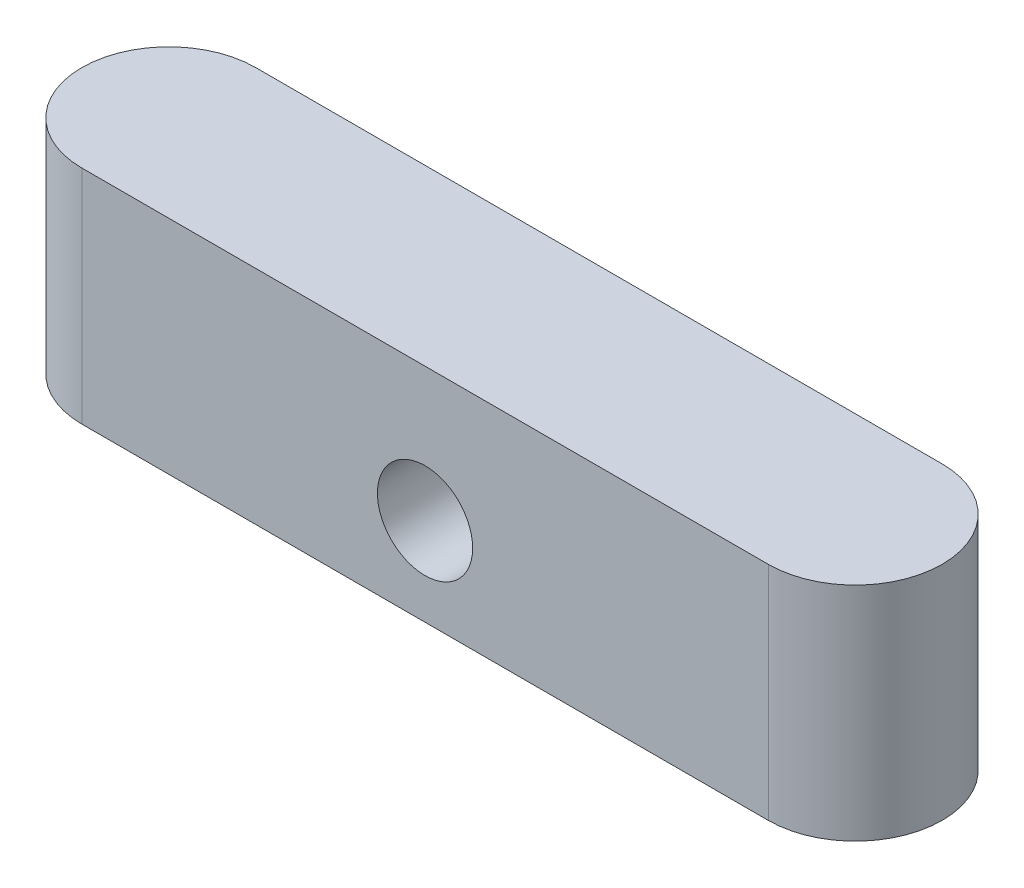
ISO-10303-21;
HEADER;
FILE_DESCRIPTION(('STEP AP214'),'2;1');
FILE_NAME('part.step','',(''),(''),'','','');
FILE_SCHEMA(('AUTOMOTIVE_DESIGN { 1 0 10303 214 1 1 1 1 }'));
ENDSEC;
DATA;
#1=APPLICATION_CONTEXT('core data for automotive mechanical design processes');
#2=APPLICATION_PROTOCOL_DEFINITION('international standard','automotive_design',2000,#1);
#3=PRODUCT_CONTEXT('',#1,'mechanical');
#4=PRODUCT('Part','Part','',(#3));
#5=PRODUCT_RELATED_PRODUCT_CATEGORY('part','',(#4));
#6=PRODUCT_DEFINITION_FORMATION('','',#4);
#7=PRODUCT_DEFINITION_CONTEXT('part definition',#1,'design');
#8=PRODUCT_DEFINITION('design','',#6,#7);
#9=PRODUCT_DEFINITION_SHAPE('','',#8);
#10=(LENGTH_UNIT() NAMED_UNIT(*) SI_UNIT(.MILLI.,.METRE.));
#11=(NAMED_UNIT(*) PLANE_ANGLE_UNIT() SI_UNIT($,.RADIAN.));
#12=(NAMED_UNIT(*) SI_UNIT($,.STERADIAN.) SOLID_ANGLE_UNIT());
#13=UNCERTAINTY_MEASURE_WITH_UNIT(LENGTH_MEASURE(1.E-05),#10,'distance_accuracy_value','');
#14=(GEOMETRIC_REPRESENTATION_CONTEXT(3) GLOBAL_UNCERTAINTY_ASSIGNED_CONTEXT((#13)) GLOBAL_UNIT_ASSIGNED_CONTEXT((#10,
#11,#12)) REPRESENTATION_CONTEXT('',''));
#15=CARTESIAN_POINT('',(0.,0.,0.));
#16=DIRECTION('',(0.,0.,1.));
#17=DIRECTION('',(1.,0.,0.));
#18=AXIS2_PLACEMENT_3D('',#15,#16,#17);
#19=CARTESIAN_POINT('',(-9.75,3.15,0.));
#20=DIRECTION('',(0.,-1.,0.));
#21=DIRECTION('',(0.,0.,-1.));
#22=AXIS2_PLACEMENT_3D('',#19,#20,#21);
#23=CYLINDRICAL_SURFACE('',#22,2.47015);
#24=CARTESIAN_POINT('',(-9.75,-3.15,0.));
#25=DIRECTION('',(0.,1.,0.));
#26=DIRECTION('',(0.,0.,1.));
#27=AXIS2_PLACEMENT_3D('',#24,#25,#26);
#28=CIRCLE('',#27,2.47015);
#29=CARTESIAN_POINT('',(-9.75,-3.15,-2.47015));
#30=VERTEX_POINT('',#29);
#31=CARTESIAN_POINT('',(-9.75,-3.15,2.47015));
#32=VERTEX_POINT('',#31);
#33=EDGE_CURVE('E97',#30,#32,#28,.T.);
#34=ORIENTED_EDGE('',*,*,#33,.T.);
#35=DIRECTION('',(0.,-1.,0.));
#36=VECTOR('',#35,1.);
#37=CARTESIAN_POINT('',(-9.75,3.15,2.47015));
#38=LINE('',#37,#36);
#39=CARTESIAN_POINT('',(-9.75,3.15,2.47015));
#40=VERTEX_POINT('',#39);
#41=EDGE_CURVE('E11',#40,#32,#38,.T.);
#42=ORIENTED_EDGE('',*,*,#41,.F.);
#43=CARTESIAN_POINT('',(-9.75,3.15,0.));
#44=DIRECTION('',(0.,1.,0.));
#45=DIRECTION('',(0.,0.,1.));
#46=AXIS2_PLACEMENT_3D('',#43,#44,#45);
#47=CIRCLE('',#46,2.47015);
#48=CARTESIAN_POINT('',(-9.75,3.15,-2.47015));
#49=VERTEX_POINT('',#48);
#50=EDGE_CURVE('E85',#49,#40,#47,.T.);
#51=ORIENTED_EDGE('',*,*,#50,.F.);
#52=DIRECTION('',(0.,-1.,0.));
#53=VECTOR('',#52,1.);
#54=CARTESIAN_POINT('',(-9.75,3.15,-2.47015));
#55=LINE('',#54,#53);
#56=EDGE_CURVE('E93',#49,#30,#55,.T.);
#57=ORIENTED_EDGE('',*,*,#56,.T.);
#58=EDGE_LOOP('',(#34,#42,#51,#57));
#59=FACE_BOUND('',#58,.T.);
#60=ADVANCED_FACE('F34',(#59),#23,.T.);
#61=CARTESIAN_POINT('',(-9.75,3.15,2.47015));
#62=DIRECTION('',(0.,0.,-1.));
#63=DIRECTION('',(-1.,0.,0.));
#64=AXIS2_PLACEMENT_3D('',#61,#62,#63);
#65=PLANE('',#64);
#66=CARTESIAN_POINT('',(0.,-0.65,2.47015));
#67=DIRECTION('',(0.,0.,1.));
#68=DIRECTION('',(1.,0.,0.));
#69=AXIS2_PLACEMENT_3D('',#66,#67,#68);
#70=CIRCLE('',#69,1.35255);
#71=CARTESIAN_POINT('',(1.35255,-0.65,2.47015));
#72=VERTEX_POINT('',#71);
#73=EDGE_CURVE('E113',#72,#72,#70,.T.);
#74=ORIENTED_EDGE('',*,*,#73,.F.);
#75=EDGE_LOOP('',(#74));
#76=FACE_BOUND('',#75,.T.);
#77=DIRECTION('',(1.,0.,0.));
#78=VECTOR('',#77,1.);
#79=CARTESIAN_POINT('',(-9.75,-3.15,2.47015));
#80=LINE('',#79,#78);
#81=CARTESIAN_POINT('',(9.75,-3.15,2.47015));
#82=VERTEX_POINT('',#81);
#83=EDGE_CURVE('E89',#32,#82,#80,.T.);
#84=ORIENTED_EDGE('',*,*,#83,.T.);
#85=DIRECTION('',(0.,-1.,0.));
#86=VECTOR('',#85,1.);
#87=CARTESIAN_POINT('',(9.75,3.15,2.47015));
#88=LINE('',#87,#86);
#89=CARTESIAN_POINT('',(9.75,3.15,2.47015));
#90=VERTEX_POINT('',#89);
#91=EDGE_CURVE('E42',#90,#82,#88,.T.);
#92=ORIENTED_EDGE('',*,*,#91,.F.);
#93=DIRECTION('',(1.,0.,0.));
#94=VECTOR('',#93,1.);
#95=CARTESIAN_POINT('',(-9.75,3.15,2.47015));
#96=LINE('',#95,#94);
#97=EDGE_CURVE('E80',#40,#90,#96,.T.);
#98=ORIENTED_EDGE('',*,*,#97,.F.);
#99=ORIENTED_EDGE('',*,*,#41,.T.);
#100=EDGE_LOOP('',(#84,#92,#98,#99));
#101=FACE_BOUND('',#100,.T.);
#102=ADVANCED_FACE('F88',(#76,#101),#65,.F.);
#103=CARTESIAN_POINT('',(9.75,3.15,0.));
#104=DIRECTION('',(0.,-1.,0.));
#105=DIRECTION('',(0.,0.,-1.));
#106=AXIS2_PLACEMENT_3D('',#103,#104,#105);
#107=CYLINDRICAL_SURFACE('',#106,2.47015);
#108=CARTESIAN_POINT('',(9.75,-3.15,0.));
#109=DIRECTION('',(0.,1.,0.));
#110=DIRECTION('',(0.,0.,1.));
#111=AXIS2_PLACEMENT_3D('',#108,#109,#110);
#112=CIRCLE('',#111,2.47015);
#113=CARTESIAN_POINT('',(9.75,-3.15,-2.47015));
#114=VERTEX_POINT('',#113);
#115=EDGE_CURVE('E67',#82,#114,#112,.T.);
#116=ORIENTED_EDGE('',*,*,#115,.T.);
#117=DIRECTION('',(0.,-1.,0.));
#118=VECTOR('',#117,1.);
#119=CARTESIAN_POINT('',(9.75,3.15,-2.47015));
#120=LINE('',#119,#118);
#121=CARTESIAN_POINT('',(9.75,3.15,-2.47015));
#122=VERTEX_POINT('',#121);
#123=EDGE_CURVE('E90',#122,#114,#120,.T.);
#124=ORIENTED_EDGE('',*,*,#123,.F.);
#125=CARTESIAN_POINT('',(9.75,3.15,0.));
#126=DIRECTION('',(0.,1.,0.));
#127=DIRECTION('',(0.,0.,1.));
#128=AXIS2_PLACEMENT_3D('',#125,#126,#127);
#129=CIRCLE('',#128,2.47015);
#130=EDGE_CURVE('E83',#90,#122,#129,.T.);
#131=ORIENTED_EDGE('',*,*,#130,.F.);
#132=ORIENTED_EDGE('',*,*,#91,.T.);
#133=EDGE_LOOP('',(#116,#124,#131,#132));
#134=FACE_BOUND('',#133,.T.);
#135=ADVANCED_FACE('F91',(#134),#107,.T.);
#136=CARTESIAN_POINT('',(-9.75,3.15,-2.47015));
#137=DIRECTION('',(0.,0.,1.));
#138=DIRECTION('',(1.,0.,0.));
#139=AXIS2_PLACEMENT_3D('',#136,#137,#138);
#140=PLANE('',#139);
#141=CARTESIAN_POINT('',(0.,-0.65,-2.47015));
#142=DIRECTION('',(0.,0.,1.));
#143=DIRECTION('',(1.,0.,0.));
#144=AXIS2_PLACEMENT_3D('',#141,#142,#143);
#145=CIRCLE('',#144,1.35255);
#146=CARTESIAN_POINT('',(1.35255,-0.65,-2.47015));
#147=VERTEX_POINT('',#146);
#148=EDGE_CURVE('E100',#147,#147,#145,.T.);
#149=ORIENTED_EDGE('',*,*,#148,.T.);
#150=EDGE_LOOP('',(#149));
#151=FACE_BOUND('',#150,.T.);
#152=DIRECTION('',(-1.,0.,0.));
#153=VECTOR('',#152,1.);
#154=CARTESIAN_POINT('',(-9.75,-3.15,-2.47015));
#155=LINE('',#154,#153);
#156=EDGE_CURVE('E73',#114,#30,#155,.T.);
#157=ORIENTED_EDGE('',*,*,#156,.T.);
#158=ORIENTED_EDGE('',*,*,#56,.F.);
#159=DIRECTION('',(-1.,0.,0.));
#160=VECTOR('',#159,1.);
#161=CARTESIAN_POINT('',(-9.75,3.15,-2.47015));
#162=LINE('',#161,#160);
#163=EDGE_CURVE('E50',#122,#49,#162,.T.);
#164=ORIENTED_EDGE('',*,*,#163,.F.);
#165=ORIENTED_EDGE('',*,*,#123,.T.);
#166=EDGE_LOOP('',(#157,#158,#164,#165));
#167=FACE_BOUND('',#166,.T.);
#168=ADVANCED_FACE('F105',(#151,#167),#140,.F.);
#169=CARTESIAN_POINT('',(-9.75,3.15,0.));
#170=DIRECTION('',(0.,1.,0.));
#171=DIRECTION('',(0.,0.,1.));
#172=AXIS2_PLACEMENT_3D('',#169,#170,#171);
#173=PLANE('',#172);
#174=ORIENTED_EDGE('',*,*,#50,.T.);
#175=ORIENTED_EDGE('',*,*,#97,.T.);
#176=ORIENTED_EDGE('',*,*,#130,.T.);
#177=ORIENTED_EDGE('',*,*,#163,.T.);
#178=EDGE_LOOP('',(#174,#175,#176,#177));
#179=FACE_BOUND('',#178,.T.);
#180=ADVANCED_FACE('F81',(#179),#173,.T.);
#181=CARTESIAN_POINT('',(-9.75,-3.15,0.));
#182=DIRECTION('',(0.,1.,0.));
#183=DIRECTION('',(0.,0.,1.));
#184=AXIS2_PLACEMENT_3D('',#181,#182,#183);
#185=PLANE('',#184);
#186=ORIENTED_EDGE('',*,*,#33,.F.);
#187=ORIENTED_EDGE('',*,*,#156,.F.);
#188=ORIENTED_EDGE('',*,*,#115,.F.);
#189=ORIENTED_EDGE('',*,*,#83,.F.);
#190=EDGE_LOOP('',(#186,#187,#188,#189));
#191=FACE_BOUND('',#190,.T.);
#192=ADVANCED_FACE('F108',(#191),#185,.F.);
#193=CARTESIAN_POINT('',(0.,-0.65,2.47015));
#194=DIRECTION('',(0.,0.,1.));
#195=DIRECTION('',(1.,0.,0.));
#196=AXIS2_PLACEMENT_3D('',#193,#194,#195);
#197=CYLINDRICAL_SURFACE('',#196,1.35255);
#198=ORIENTED_EDGE('',*,*,#148,.F.);
#199=EDGE_LOOP('',(#198));
#200=FACE_BOUND('',#199,.T.);
#201=ORIENTED_EDGE('',*,*,#73,.T.);
#202=EDGE_LOOP('',(#201));
#203=FACE_BOUND('',#202,.T.);
#204=ADVANCED_FACE('F117',(#200,#203),#197,.F.);
#205=CLOSED_SHELL('',(#60,#102,#135,#168,#180,#192,#204));
#206=MANIFOLD_SOLID_BREP('B2',#205);
#207=ADVANCED_BREP_SHAPE_REPRESENTATION('',(#18,#206),#14);
#208=SHAPE_DEFINITION_REPRESENTATION(#9,#207);
ENDSEC;
END-ISO-10303-21;
